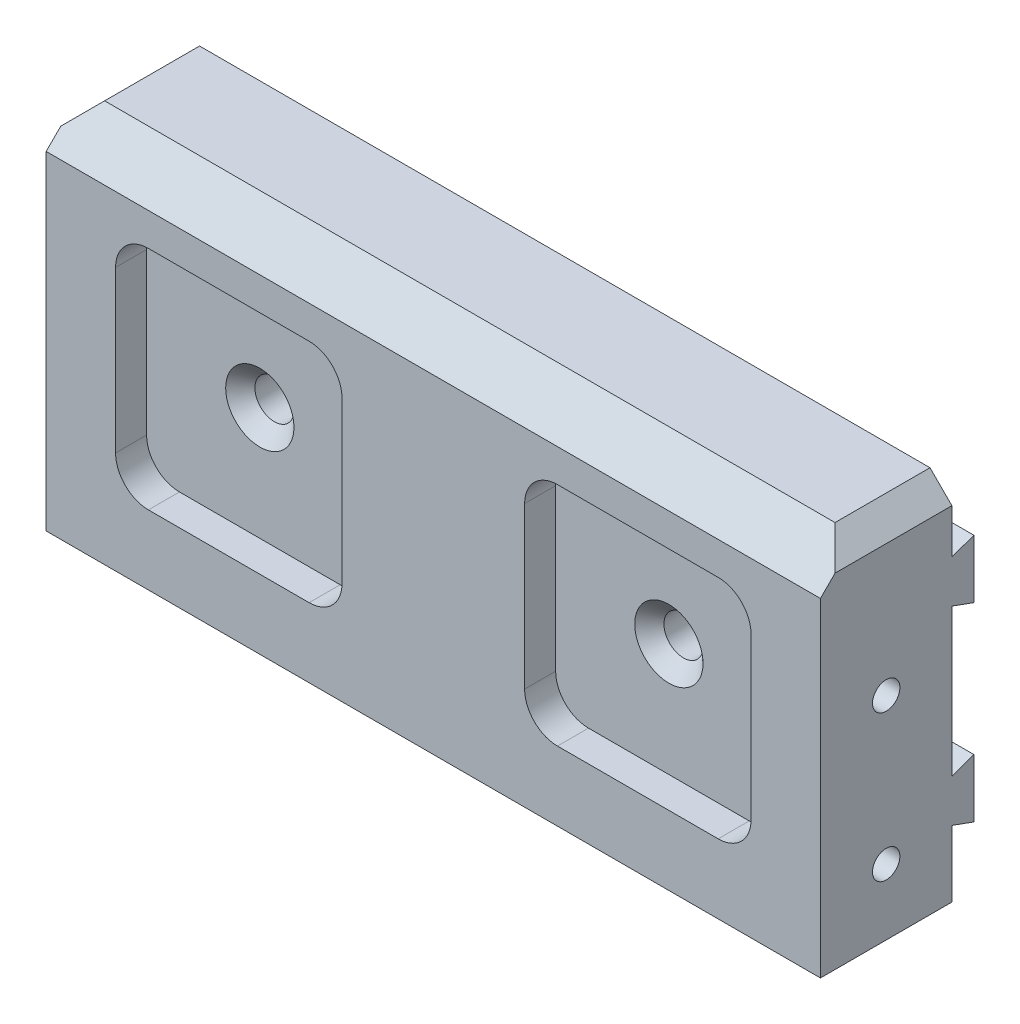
ISO-10303-21;
HEADER;
FILE_DESCRIPTION(('STEP AP214'),'2;1');
FILE_NAME('part.step','',(''),(''),'','','');
FILE_SCHEMA(('AUTOMOTIVE_DESIGN { 1 0 10303 214 1 1 1 1 }'));
ENDSEC;
DATA;
#1=APPLICATION_CONTEXT('core data for automotive mechanical design processes');
#2=APPLICATION_PROTOCOL_DEFINITION('international standard','automotive_design',2000,#1);
#3=PRODUCT_CONTEXT('',#1,'mechanical');
#4=PRODUCT('Part','Part','',(#3));
#5=PRODUCT_RELATED_PRODUCT_CATEGORY('part','',(#4));
#6=PRODUCT_DEFINITION_FORMATION('','',#4);
#7=PRODUCT_DEFINITION_CONTEXT('part definition',#1,'design');
#8=PRODUCT_DEFINITION('design','',#6,#7);
#9=PRODUCT_DEFINITION_SHAPE('','',#8);
#10=(LENGTH_UNIT() NAMED_UNIT(*) SI_UNIT(.MILLI.,.METRE.));
#11=(NAMED_UNIT(*) PLANE_ANGLE_UNIT() SI_UNIT($,.RADIAN.));
#12=(NAMED_UNIT(*) SI_UNIT($,.STERADIAN.) SOLID_ANGLE_UNIT());
#13=UNCERTAINTY_MEASURE_WITH_UNIT(LENGTH_MEASURE(1.E-05),#10,'distance_accuracy_value','');
#14=(GEOMETRIC_REPRESENTATION_CONTEXT(3) GLOBAL_UNCERTAINTY_ASSIGNED_CONTEXT((#13)) GLOBAL_UNIT_ASSIGNED_CONTEXT((#10,
#11,#12)) REPRESENTATION_CONTEXT('',''));
#15=CARTESIAN_POINT('',(0.,0.,0.));
#16=DIRECTION('',(0.,0.,1.));
#17=DIRECTION('',(1.,0.,0.));
#18=AXIS2_PLACEMENT_3D('',#15,#16,#17);
#19=CARTESIAN_POINT('',(0.,0.,-9.));
#20=DIRECTION('',(0.,0.,-1.));
#21=DIRECTION('',(-1.,0.,0.));
#22=AXIS2_PLACEMENT_3D('',#19,#20,#21);
#23=PLANE('',#22);
#24=DIRECTION('',(-1.,0.,0.));
#25=VECTOR('',#24,1.);
#26=CARTESIAN_POINT('',(61.5440037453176,-15.9080892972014,-8.99999999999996));
#27=LINE('',#26,#25);
#28=CARTESIAN_POINT('',(53.,-15.9080892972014,-8.99999999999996));
#29=VERTEX_POINT('',#28);
#30=CARTESIAN_POINT('',(-53.,-15.9080892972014,-8.99999999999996));
#31=VERTEX_POINT('',#30);
#32=EDGE_CURVE('E243',#29,#31,#27,.T.);
#33=ORIENTED_EDGE('',*,*,#32,.F.);
#34=DIRECTION('',(0.,1.,0.));
#35=VECTOR('',#34,1.);
#36=CARTESIAN_POINT('',(53.,-25.,-9.));
#37=LINE('',#36,#35);
#38=CARTESIAN_POINT('',(53.,-25.,-9.));
#39=VERTEX_POINT('',#38);
#40=EDGE_CURVE('E275',#39,#29,#37,.T.);
#41=ORIENTED_EDGE('',*,*,#40,.F.);
#42=DIRECTION('',(1.,0.,0.));
#43=VECTOR('',#42,1.);
#44=CARTESIAN_POINT('',(-53.,-25.,-9.));
#45=LINE('',#44,#43);
#46=CARTESIAN_POINT('',(-53.,-25.,-9.));
#47=VERTEX_POINT('',#46);
#48=EDGE_CURVE('E268',#47,#39,#45,.T.);
#49=ORIENTED_EDGE('',*,*,#48,.F.);
#50=DIRECTION('',(0.,-1.,0.));
#51=VECTOR('',#50,1.);
#52=CARTESIAN_POINT('',(-53.,-25.,-9.));
#53=LINE('',#52,#51);
#54=EDGE_CURVE('E260',#31,#47,#53,.T.);
#55=ORIENTED_EDGE('',*,*,#54,.F.);
#56=EDGE_LOOP('',(#33,#41,#49,#55));
#57=FACE_BOUND('',#56,.T.);
#58=ADVANCED_FACE('F38',(#57),#23,.T.);
#59=DIRECTION('',(-1.,0.,0.));
#60=VECTOR('',#59,1.);
#61=CARTESIAN_POINT('',(-53.,25.,-9.));
#62=LINE('',#61,#60);
#63=CARTESIAN_POINT('',(50.,25.,-9.));
#64=VERTEX_POINT('',#63);
#65=CARTESIAN_POINT('',(-50.,25.,-9.));
#66=VERTEX_POINT('',#65);
#67=EDGE_CURVE('E270',#64,#66,#62,.T.);
#68=ORIENTED_EDGE('',*,*,#67,.F.);
#69=DIRECTION('',(-0.707106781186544,0.707106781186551,0.));
#70=VECTOR('',#69,1.);
#71=CARTESIAN_POINT('',(37.5000000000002,37.4999999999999,-9.));
#72=LINE('',#71,#70);
#73=CARTESIAN_POINT('',(53.,22.,-9.));
#74=VERTEX_POINT('',#73);
#75=EDGE_CURVE('E324',#64,#74,#72,.F.);
#76=ORIENTED_EDGE('',*,*,#75,.T.);
#77=CARTESIAN_POINT('',(53.,15.9080892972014,-9.));
#78=VERTEX_POINT('',#77);
#79=EDGE_CURVE('E518',#78,#74,#37,.T.);
#80=ORIENTED_EDGE('',*,*,#79,.F.);
#81=DIRECTION('',(-1.,0.,0.));
#82=VECTOR('',#81,1.);
#83=CARTESIAN_POINT('',(61.5440037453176,15.9080892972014,-8.99999999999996));
#84=LINE('',#83,#82);
#85=CARTESIAN_POINT('',(-53.,15.9080892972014,-9.));
#86=VERTEX_POINT('',#85);
#87=EDGE_CURVE('E550',#78,#86,#84,.T.);
#88=ORIENTED_EDGE('',*,*,#87,.T.);
#89=CARTESIAN_POINT('',(-53.,22.,-9.));
#90=VERTEX_POINT('',#89);
#91=EDGE_CURVE('E272',#90,#86,#53,.T.);
#92=ORIENTED_EDGE('',*,*,#91,.F.);
#93=DIRECTION('',(-0.707106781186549,-0.707106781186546,0.));
#94=VECTOR('',#93,1.);
#95=CARTESIAN_POINT('',(-37.4999999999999,37.5,-9.));
#96=LINE('',#95,#94);
#97=EDGE_CURVE('E322',#90,#66,#96,.F.);
#98=ORIENTED_EDGE('',*,*,#97,.T.);
#99=EDGE_LOOP('',(#68,#76,#80,#88,#92,#98));
#100=FACE_BOUND('',#99,.T.);
#101=ADVANCED_FACE('F353',(#100),#23,.T.);
#102=CARTESIAN_POINT('',(53.,-25.,9.));
#103=DIRECTION('',(-1.,0.,0.));
#104=DIRECTION('',(0.,0.,1.));
#105=AXIS2_PLACEMENT_3D('',#102,#103,#104);
#106=PLANE('',#105);
#107=CARTESIAN_POINT('',(53.,-16.,0.));
#108=DIRECTION('',(-1.,0.,0.));
#109=DIRECTION('',(0.,0.,1.));
#110=AXIS2_PLACEMENT_3D('',#107,#108,#109);
#111=CIRCLE('',#110,1.875);
#112=CARTESIAN_POINT('',(53.,-16.,1.875));
#113=VERTEX_POINT('',#112);
#114=EDGE_CURVE('E718',#113,#113,#111,.T.);
#115=ORIENTED_EDGE('',*,*,#114,.T.);
#116=EDGE_LOOP('',(#115));
#117=FACE_BOUND('',#116,.T.);
#118=CARTESIAN_POINT('',(53.,3.99999999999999,0.));
#119=DIRECTION('',(-1.,0.,0.));
#120=DIRECTION('',(0.,0.,1.));
#121=AXIS2_PLACEMENT_3D('',#118,#119,#120);
#122=CIRCLE('',#121,1.875);
#123=CARTESIAN_POINT('',(53.,3.99999999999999,1.875));
#124=VERTEX_POINT('',#123);
#125=EDGE_CURVE('E712',#124,#124,#122,.T.);
#126=ORIENTED_EDGE('',*,*,#125,.T.);
#127=EDGE_LOOP('',(#126));
#128=FACE_BOUND('',#127,.T.);
#129=ORIENTED_EDGE('',*,*,#79,.T.);
#130=DIRECTION('',(0.,0.,1.));
#131=VECTOR('',#130,1.);
#132=CARTESIAN_POINT('',(53.,22.,9.));
#133=LINE('',#132,#131);
#134=CARTESIAN_POINT('',(53.,22.,6.99999999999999));
#135=VERTEX_POINT('',#134);
#136=EDGE_CURVE('E61',#74,#135,#133,.T.);
#137=ORIENTED_EDGE('',*,*,#136,.T.);
#138=DIRECTION('',(0.,0.707106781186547,-0.707106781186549));
#139=VECTOR('',#138,1.);
#140=CARTESIAN_POINT('',(53.,20.,9.));
#141=LINE('',#140,#139);
#142=CARTESIAN_POINT('',(53.,20.,9.));
#143=VERTEX_POINT('',#142);
#144=EDGE_CURVE('E303',#135,#143,#141,.F.);
#145=ORIENTED_EDGE('',*,*,#144,.T.);
#146=DIRECTION('',(0.,1.,0.));
#147=VECTOR('',#146,1.);
#148=CARTESIAN_POINT('',(53.,-25.,9.));
#149=LINE('',#148,#147);
#150=CARTESIAN_POINT('',(53.,-25.,9.));
#151=VERTEX_POINT('',#150);
#152=EDGE_CURVE('E282',#151,#143,#149,.T.);
#153=ORIENTED_EDGE('',*,*,#152,.F.);
#154=DIRECTION('',(0.,0.,-1.));
#155=VECTOR('',#154,1.);
#156=CARTESIAN_POINT('',(53.,-25.,9.));
#157=LINE('',#156,#155);
#158=EDGE_CURVE('E290',#151,#39,#157,.T.);
#159=ORIENTED_EDGE('',*,*,#158,.T.);
#160=ORIENTED_EDGE('',*,*,#40,.T.);
#161=DIRECTION('',(0.,-0.342020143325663,-0.939692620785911));
#162=VECTOR('',#161,1.);
#163=CARTESIAN_POINT('',(53.,-17.,-12.));
#164=LINE('',#163,#162);
#165=CARTESIAN_POINT('',(53.,-17.,-12.));
#166=VERTEX_POINT('',#165);
#167=EDGE_CURVE('E249',#29,#166,#164,.T.);
#168=ORIENTED_EDGE('',*,*,#167,.T.);
#169=DIRECTION('',(0.,1.,0.));
#170=VECTOR('',#169,1.);
#171=CARTESIAN_POINT('',(53.,-8.99999999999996,-12.));
#172=LINE('',#171,#170);
#173=CARTESIAN_POINT('',(53.,-8.99999999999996,-12.));
#174=VERTEX_POINT('',#173);
#175=EDGE_CURVE('E564',#166,#174,#172,.T.);
#176=ORIENTED_EDGE('',*,*,#175,.T.);
#177=DIRECTION('',(0.,-0.342020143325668,0.939692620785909));
#178=VECTOR('',#177,1.);
#179=CARTESIAN_POINT('',(53.,-10.0919107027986,-9.));
#180=LINE('',#179,#178);
#181=CARTESIAN_POINT('',(53.,-10.0919107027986,-9.));
#182=VERTEX_POINT('',#181);
#183=EDGE_CURVE('E694',#174,#182,#180,.T.);
#184=ORIENTED_EDGE('',*,*,#183,.T.);
#185=CARTESIAN_POINT('',(53.,10.0919107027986,-9.));
#186=VERTEX_POINT('',#185);
#187=EDGE_CURVE('E532',#182,#186,#37,.T.);
#188=ORIENTED_EDGE('',*,*,#187,.T.);
#189=DIRECTION('',(0.,-0.342020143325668,-0.939692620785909));
#190=VECTOR('',#189,1.);
#191=CARTESIAN_POINT('',(53.,10.0919107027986,-9.));
#192=LINE('',#191,#190);
#193=CARTESIAN_POINT('',(53.,8.99999999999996,-12.));
#194=VERTEX_POINT('',#193);
#195=EDGE_CURVE('E567',#186,#194,#192,.T.);
#196=ORIENTED_EDGE('',*,*,#195,.T.);
#197=DIRECTION('',(0.,1.,0.));
#198=VECTOR('',#197,1.);
#199=CARTESIAN_POINT('',(53.,8.99999999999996,-12.));
#200=LINE('',#199,#198);
#201=CARTESIAN_POINT('',(53.,17.,-12.));
#202=VERTEX_POINT('',#201);
#203=EDGE_CURVE('E575',#194,#202,#200,.T.);
#204=ORIENTED_EDGE('',*,*,#203,.T.);
#205=DIRECTION('',(0.,-0.342020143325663,0.939692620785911));
#206=VECTOR('',#205,1.);
#207=CARTESIAN_POINT('',(53.,17.,-12.));
#208=LINE('',#207,#206);
#209=EDGE_CURVE('E535',#202,#78,#208,.T.);
#210=ORIENTED_EDGE('',*,*,#209,.T.);
#211=EDGE_LOOP('',(#129,#137,#145,#153,#159,#160,#168,#176,#184,#188,#196,#204,#210));
#212=FACE_BOUND('',#211,.T.);
#213=ADVANCED_FACE('F359',(#117,#128,#212),#106,.F.);
#214=CARTESIAN_POINT('',(-53.,25.,9.));
#215=DIRECTION('',(0.,-1.,0.));
#216=DIRECTION('',(0.,0.,-1.));
#217=AXIS2_PLACEMENT_3D('',#214,#215,#216);
#218=PLANE('',#217);
#219=DIRECTION('',(1.,0.,0.));
#220=VECTOR('',#219,1.);
#221=CARTESIAN_POINT('',(-53.,25.,3.99999999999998));
#222=LINE('',#221,#220);
#223=CARTESIAN_POINT('',(-50.,25.,3.99999999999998));
#224=VERTEX_POINT('',#223);
#225=CARTESIAN_POINT('',(50.,25.,3.99999999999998));
#226=VERTEX_POINT('',#225);
#227=EDGE_CURVE('E300',#224,#226,#222,.T.);
#228=ORIENTED_EDGE('',*,*,#227,.T.);
#229=DIRECTION('',(0.,0.,-1.));
#230=VECTOR('',#229,1.);
#231=CARTESIAN_POINT('',(50.,25.,9.));
#232=LINE('',#231,#230);
#233=EDGE_CURVE('E319',#226,#64,#232,.T.);
#234=ORIENTED_EDGE('',*,*,#233,.T.);
#235=ORIENTED_EDGE('',*,*,#67,.T.);
#236=DIRECTION('',(0.,0.,1.));
#237=VECTOR('',#236,1.);
#238=CARTESIAN_POINT('',(-50.,25.,9.));
#239=LINE('',#238,#237);
#240=EDGE_CURVE('E317',#66,#224,#239,.T.);
#241=ORIENTED_EDGE('',*,*,#240,.T.);
#242=EDGE_LOOP('',(#228,#234,#235,#241));
#243=FACE_BOUND('',#242,.T.);
#244=ADVANCED_FACE('F543',(#243),#218,.F.);
#245=CARTESIAN_POINT('',(-53.,-25.,9.));
#246=DIRECTION('',(1.,0.,0.));
#247=DIRECTION('',(0.,0.,-1.));
#248=AXIS2_PLACEMENT_3D('',#245,#246,#247);
#249=PLANE('',#248);
#250=CARTESIAN_POINT('',(-53.,-16.,0.));
#251=DIRECTION('',(-1.,0.,0.));
#252=DIRECTION('',(0.,0.,1.));
#253=AXIS2_PLACEMENT_3D('',#250,#251,#252);
#254=CIRCLE('',#253,1.875);
#255=CARTESIAN_POINT('',(-53.,-16.,1.875));
#256=VERTEX_POINT('',#255);
#257=EDGE_CURVE('E706',#256,#256,#254,.T.);
#258=ORIENTED_EDGE('',*,*,#257,.F.);
#259=EDGE_LOOP('',(#258));
#260=FACE_BOUND('',#259,.T.);
#261=CARTESIAN_POINT('',(-53.,3.99999999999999,0.));
#262=DIRECTION('',(-1.,0.,0.));
#263=DIRECTION('',(0.,0.,1.));
#264=AXIS2_PLACEMENT_3D('',#261,#262,#263);
#265=CIRCLE('',#264,1.875);
#266=CARTESIAN_POINT('',(-53.,3.99999999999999,1.875));
#267=VERTEX_POINT('',#266);
#268=EDGE_CURVE('E700',#267,#267,#265,.T.);
#269=ORIENTED_EDGE('',*,*,#268,.F.);
#270=EDGE_LOOP('',(#269));
#271=FACE_BOUND('',#270,.T.);
#272=DIRECTION('',(0.,-0.707106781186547,0.707106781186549));
#273=VECTOR('',#272,1.);
#274=CARTESIAN_POINT('',(-53.,20.,9.));
#275=LINE('',#274,#273);
#276=CARTESIAN_POINT('',(-53.,20.,9.));
#277=VERTEX_POINT('',#276);
#278=CARTESIAN_POINT('',(-53.,22.,6.99999999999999));
#279=VERTEX_POINT('',#278);
#280=EDGE_CURVE('E298',#277,#279,#275,.F.);
#281=ORIENTED_EDGE('',*,*,#280,.T.);
#282=DIRECTION('',(0.,0.,-1.));
#283=VECTOR('',#282,1.);
#284=CARTESIAN_POINT('',(-53.,22.,9.));
#285=LINE('',#284,#283);
#286=EDGE_CURVE('E330',#279,#90,#285,.T.);
#287=ORIENTED_EDGE('',*,*,#286,.T.);
#288=ORIENTED_EDGE('',*,*,#91,.T.);
#289=DIRECTION('',(0.,0.342020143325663,-0.939692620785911));
#290=VECTOR('',#289,1.);
#291=CARTESIAN_POINT('',(-53.,17.,-12.));
#292=LINE('',#291,#290);
#293=CARTESIAN_POINT('',(-53.,17.,-12.));
#294=VERTEX_POINT('',#293);
#295=EDGE_CURVE('E556',#86,#294,#292,.T.);
#296=ORIENTED_EDGE('',*,*,#295,.T.);
#297=DIRECTION('',(0.,-1.,0.));
#298=VECTOR('',#297,1.);
#299=CARTESIAN_POINT('',(-53.,8.99999999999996,-12.));
#300=LINE('',#299,#298);
#301=CARTESIAN_POINT('',(-53.,8.99999999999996,-12.));
#302=VERTEX_POINT('',#301);
#303=EDGE_CURVE('E561',#294,#302,#300,.T.);
#304=ORIENTED_EDGE('',*,*,#303,.T.);
#305=DIRECTION('',(0.,0.342020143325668,0.939692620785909));
#306=VECTOR('',#305,1.);
#307=CARTESIAN_POINT('',(-53.,10.0919107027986,-9.));
#308=LINE('',#307,#306);
#309=CARTESIAN_POINT('',(-53.,10.0919107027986,-9.));
#310=VERTEX_POINT('',#309);
#311=EDGE_CURVE('E554',#302,#310,#308,.T.);
#312=ORIENTED_EDGE('',*,*,#311,.T.);
#313=CARTESIAN_POINT('',(-53.,-10.0919107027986,-9.));
#314=VERTEX_POINT('',#313);
#315=EDGE_CURVE('E269',#310,#314,#53,.T.);
#316=ORIENTED_EDGE('',*,*,#315,.T.);
#317=DIRECTION('',(0.,0.342020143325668,-0.939692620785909));
#318=VECTOR('',#317,1.);
#319=CARTESIAN_POINT('',(-53.,-10.0919107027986,-9.));
#320=LINE('',#319,#318);
#321=CARTESIAN_POINT('',(-53.,-8.99999999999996,-12.));
#322=VERTEX_POINT('',#321);
#323=EDGE_CURVE('E264',#314,#322,#320,.T.);
#324=ORIENTED_EDGE('',*,*,#323,.T.);
#325=DIRECTION('',(0.,-1.,0.));
#326=VECTOR('',#325,1.);
#327=CARTESIAN_POINT('',(-53.,-8.99999999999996,-12.));
#328=LINE('',#327,#326);
#329=CARTESIAN_POINT('',(-53.,-17.,-12.));
#330=VERTEX_POINT('',#329);
#331=EDGE_CURVE('E255',#322,#330,#328,.T.);
#332=ORIENTED_EDGE('',*,*,#331,.T.);
#333=DIRECTION('',(0.,0.342020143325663,0.939692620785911));
#334=VECTOR('',#333,1.);
#335=CARTESIAN_POINT('',(-53.,-17.,-12.));
#336=LINE('',#335,#334);
#337=EDGE_CURVE('E247',#330,#31,#336,.T.);
#338=ORIENTED_EDGE('',*,*,#337,.T.);
#339=ORIENTED_EDGE('',*,*,#54,.T.);
#340=DIRECTION('',(0.,0.,-1.));
#341=VECTOR('',#340,1.);
#342=CARTESIAN_POINT('',(-53.,-25.,9.));
#343=LINE('',#342,#341);
#344=CARTESIAN_POINT('',(-53.,-25.,9.));
#345=VERTEX_POINT('',#344);
#346=EDGE_CURVE('E292',#345,#47,#343,.T.);
#347=ORIENTED_EDGE('',*,*,#346,.F.);
#348=DIRECTION('',(0.,-1.,0.));
#349=VECTOR('',#348,1.);
#350=CARTESIAN_POINT('',(-53.,-25.,9.));
#351=LINE('',#350,#349);
#352=EDGE_CURVE('E287',#277,#345,#351,.T.);
#353=ORIENTED_EDGE('',*,*,#352,.F.);
#354=EDGE_LOOP('',(#281,#287,#288,#296,#304,#312,#316,#324,#332,#338,#339,#347,#353));
#355=FACE_BOUND('',#354,.T.);
#356=ADVANCED_FACE('F258',(#260,#271,#355),#249,.F.);
#357=CARTESIAN_POINT('',(-53.,-25.,9.));
#358=DIRECTION('',(0.,1.,0.));
#359=DIRECTION('',(0.,0.,1.));
#360=AXIS2_PLACEMENT_3D('',#357,#358,#359);
#361=PLANE('',#360);
#362=ORIENTED_EDGE('',*,*,#48,.T.);
#363=ORIENTED_EDGE('',*,*,#158,.F.);
#364=DIRECTION('',(1.,0.,0.));
#365=VECTOR('',#364,1.);
#366=CARTESIAN_POINT('',(-53.,-25.,9.));
#367=LINE('',#366,#365);
#368=EDGE_CURVE('E293',#345,#151,#367,.T.);
#369=ORIENTED_EDGE('',*,*,#368,.F.);
#370=ORIENTED_EDGE('',*,*,#346,.T.);
#371=EDGE_LOOP('',(#362,#363,#369,#370));
#372=FACE_BOUND('',#371,.T.);
#373=ADVANCED_FACE('F373',(#372),#361,.F.);
#374=CARTESIAN_POINT('',(0.,0.,9.));
#375=DIRECTION('',(0.,0.,-1.));
#376=DIRECTION('',(-1.,0.,0.));
#377=AXIS2_PLACEMENT_3D('',#374,#375,#376);
#378=PLANE('',#377);
#379=DIRECTION('',(0.,1.,0.));
#380=VECTOR('',#379,1.);
#381=CARTESIAN_POINT('',(43.5,-11.,9.));
#382=LINE('',#381,#380);
#383=CARTESIAN_POINT('',(43.5,-11.,9.));
#384=VERTEX_POINT('',#383);
#385=CARTESIAN_POINT('',(43.5,11.,9.));
#386=VERTEX_POINT('',#385);
#387=EDGE_CURVE('E608',#384,#386,#382,.T.);
#388=ORIENTED_EDGE('',*,*,#387,.F.);
#389=CARTESIAN_POINT('',(39.,-11.,9.));
#390=DIRECTION('',(0.,0.,1.));
#391=DIRECTION('',(1.,0.,0.));
#392=AXIS2_PLACEMENT_3D('',#389,#390,#391);
#393=CIRCLE('',#392,4.5);
#394=CARTESIAN_POINT('',(39.,-15.5,9.));
#395=VERTEX_POINT('',#394);
#396=EDGE_CURVE('E580',#395,#384,#393,.T.);
#397=ORIENTED_EDGE('',*,*,#396,.F.);
#398=DIRECTION('',(1.,0.,0.));
#399=VECTOR('',#398,1.);
#400=CARTESIAN_POINT('',(17.,-15.5,9.));
#401=LINE('',#400,#399);
#402=CARTESIAN_POINT('',(17.,-15.5,9.));
#403=VERTEX_POINT('',#402);
#404=EDGE_CURVE('E585',#403,#395,#401,.T.);
#405=ORIENTED_EDGE('',*,*,#404,.F.);
#406=CARTESIAN_POINT('',(17.,-11.,9.));
#407=DIRECTION('',(0.,0.,1.));
#408=DIRECTION('',(1.,0.,0.));
#409=AXIS2_PLACEMENT_3D('',#406,#407,#408);
#410=CIRCLE('',#409,4.5);
#411=CARTESIAN_POINT('',(12.5,-11.,9.));
#412=VERTEX_POINT('',#411);
#413=EDGE_CURVE('E623',#412,#403,#410,.T.);
#414=ORIENTED_EDGE('',*,*,#413,.F.);
#415=DIRECTION('',(0.,-1.,0.));
#416=VECTOR('',#415,1.);
#417=CARTESIAN_POINT('',(12.5,11.,9.));
#418=LINE('',#417,#416);
#419=CARTESIAN_POINT('',(12.5,11.,9.));
#420=VERTEX_POINT('',#419);
#421=EDGE_CURVE('E620',#420,#412,#418,.T.);
#422=ORIENTED_EDGE('',*,*,#421,.F.);
#423=CARTESIAN_POINT('',(17.,11.,9.));
#424=DIRECTION('',(0.,0.,1.));
#425=DIRECTION('',(1.,0.,0.));
#426=AXIS2_PLACEMENT_3D('',#423,#424,#425);
#427=CIRCLE('',#426,4.5);
#428=CARTESIAN_POINT('',(17.,15.5,9.));
#429=VERTEX_POINT('',#428);
#430=EDGE_CURVE('E617',#429,#420,#427,.T.);
#431=ORIENTED_EDGE('',*,*,#430,.F.);
#432=DIRECTION('',(-1.,0.,0.));
#433=VECTOR('',#432,1.);
#434=CARTESIAN_POINT('',(39.,15.5,9.));
#435=LINE('',#434,#433);
#436=CARTESIAN_POINT('',(39.,15.5,9.));
#437=VERTEX_POINT('',#436);
#438=EDGE_CURVE('E614',#437,#429,#435,.T.);
#439=ORIENTED_EDGE('',*,*,#438,.F.);
#440=CARTESIAN_POINT('',(39.,11.,9.));
#441=DIRECTION('',(0.,0.,1.));
#442=DIRECTION('',(1.,0.,0.));
#443=AXIS2_PLACEMENT_3D('',#440,#441,#442);
#444=CIRCLE('',#443,4.5);
#445=EDGE_CURVE('E611',#386,#437,#444,.T.);
#446=ORIENTED_EDGE('',*,*,#445,.F.);
#447=EDGE_LOOP('',(#388,#397,#405,#414,#422,#431,#439,#446));
#448=FACE_BOUND('',#447,.T.);
#449=DIRECTION('',(0.,1.,0.));
#450=VECTOR('',#449,1.);
#451=CARTESIAN_POINT('',(-12.5,11.,9.));
#452=LINE('',#451,#450);
#453=CARTESIAN_POINT('',(-12.5,-11.,9.));
#454=VERTEX_POINT('',#453);
#455=CARTESIAN_POINT('',(-12.5,11.,9.));
#456=VERTEX_POINT('',#455);
#457=EDGE_CURVE('E483',#454,#456,#452,.T.);
#458=ORIENTED_EDGE('',*,*,#457,.F.);
#459=CARTESIAN_POINT('',(-17.,-11.,9.));
#460=DIRECTION('',(0.,0.,1.));
#461=DIRECTION('',(-1.,0.,0.));
#462=AXIS2_PLACEMENT_3D('',#459,#460,#461);
#463=CIRCLE('',#462,4.5);
#464=CARTESIAN_POINT('',(-17.,-15.5,9.));
#465=VERTEX_POINT('',#464);
#466=EDGE_CURVE('E473',#465,#454,#463,.T.);
#467=ORIENTED_EDGE('',*,*,#466,.F.);
#468=DIRECTION('',(1.,0.,0.));
#469=VECTOR('',#468,1.);
#470=CARTESIAN_POINT('',(-17.,-15.5,9.));
#471=LINE('',#470,#469);
#472=CARTESIAN_POINT('',(-39.,-15.5,9.));
#473=VERTEX_POINT('',#472);
#474=EDGE_CURVE('E514',#473,#465,#471,.T.);
#475=ORIENTED_EDGE('',*,*,#474,.F.);
#476=CARTESIAN_POINT('',(-39.,-11.,9.));
#477=DIRECTION('',(0.,0.,1.));
#478=DIRECTION('',(-1.,0.,0.));
#479=AXIS2_PLACEMENT_3D('',#476,#477,#478);
#480=CIRCLE('',#479,4.5);
#481=CARTESIAN_POINT('',(-43.5,-11.,9.));
#482=VERTEX_POINT('',#481);
#483=EDGE_CURVE('E511',#482,#473,#480,.T.);
#484=ORIENTED_EDGE('',*,*,#483,.F.);
#485=DIRECTION('',(0.,-1.,0.));
#486=VECTOR('',#485,1.);
#487=CARTESIAN_POINT('',(-43.5,-11.,9.));
#488=LINE('',#487,#486);
#489=CARTESIAN_POINT('',(-43.5,11.,9.));
#490=VERTEX_POINT('',#489);
#491=EDGE_CURVE('E508',#490,#482,#488,.T.);
#492=ORIENTED_EDGE('',*,*,#491,.F.);
#493=CARTESIAN_POINT('',(-39.,11.,9.));
#494=DIRECTION('',(0.,0.,1.));
#495=DIRECTION('',(-1.,0.,0.));
#496=AXIS2_PLACEMENT_3D('',#493,#494,#495);
#497=CIRCLE('',#496,4.5);
#498=CARTESIAN_POINT('',(-39.,15.5,9.));
#499=VERTEX_POINT('',#498);
#500=EDGE_CURVE('E505',#499,#490,#497,.T.);
#501=ORIENTED_EDGE('',*,*,#500,.F.);
#502=DIRECTION('',(-1.,0.,0.));
#503=VECTOR('',#502,1.);
#504=CARTESIAN_POINT('',(-39.,15.5,9.));
#505=LINE('',#504,#503);
#506=CARTESIAN_POINT('',(-17.,15.5,9.));
#507=VERTEX_POINT('',#506);
#508=EDGE_CURVE('E499',#507,#499,#505,.T.);
#509=ORIENTED_EDGE('',*,*,#508,.F.);
#510=CARTESIAN_POINT('',(-17.,11.,9.));
#511=DIRECTION('',(0.,0.,1.));
#512=DIRECTION('',(-1.,0.,0.));
#513=AXIS2_PLACEMENT_3D('',#510,#511,#512);
#514=CIRCLE('',#513,4.5);
#515=EDGE_CURVE('E497',#456,#507,#514,.T.);
#516=ORIENTED_EDGE('',*,*,#515,.F.);
#517=EDGE_LOOP('',(#458,#467,#475,#484,#492,#501,#509,#516));
#518=FACE_BOUND('',#517,.T.);
#519=ORIENTED_EDGE('',*,*,#152,.T.);
#520=DIRECTION('',(-1.,0.,0.));
#521=VECTOR('',#520,1.);
#522=CARTESIAN_POINT('',(0.,20.,9.));
#523=LINE('',#522,#521);
#524=EDGE_CURVE('E295',#143,#277,#523,.T.);
#525=ORIENTED_EDGE('',*,*,#524,.T.);
#526=ORIENTED_EDGE('',*,*,#352,.T.);
#527=ORIENTED_EDGE('',*,*,#368,.T.);
#528=EDGE_LOOP('',(#519,#525,#526,#527));
#529=FACE_BOUND('',#528,.T.);
#530=ADVANCED_FACE('F365',(#448,#518,#529),#378,.F.);
#531=DIRECTION('',(-1.,0.,0.));
#532=VECTOR('',#531,1.);
#533=CARTESIAN_POINT('',(61.5440037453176,-10.0919107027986,-9.));
#534=LINE('',#533,#532);
#535=EDGE_CURVE('E254',#182,#314,#534,.T.);
#536=ORIENTED_EDGE('',*,*,#535,.T.);
#537=ORIENTED_EDGE('',*,*,#315,.F.);
#538=DIRECTION('',(-1.,0.,0.));
#539=VECTOR('',#538,1.);
#540=CARTESIAN_POINT('',(61.5440037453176,10.0919107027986,-9.));
#541=LINE('',#540,#539);
#542=EDGE_CURVE('E572',#186,#310,#541,.T.);
#543=ORIENTED_EDGE('',*,*,#542,.F.);
#544=ORIENTED_EDGE('',*,*,#187,.F.);
#545=EDGE_LOOP('',(#536,#537,#543,#544));
#546=FACE_BOUND('',#545,.T.);
#547=CARTESIAN_POINT('',(-28.,-1.17961196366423E-13,-9.));
#548=DIRECTION('',(0.,0.,-1.));
#549=DIRECTION('',(-1.,0.,0.));
#550=AXIS2_PLACEMENT_3D('',#547,#548,#549);
#551=CIRCLE('',#550,5.67499999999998);
#552=CARTESIAN_POINT('',(-33.675,-1.17961196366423E-13,-9.));
#553=VERTEX_POINT('',#552);
#554=EDGE_CURVE('E311',#553,#553,#551,.F.);
#555=ORIENTED_EDGE('',*,*,#554,.T.);
#556=EDGE_LOOP('',(#555));
#557=FACE_BOUND('',#556,.T.);
#558=CARTESIAN_POINT('',(28.,-1.2490009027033E-13,-9.));
#559=DIRECTION('',(0.,0.,-1.));
#560=DIRECTION('',(-1.,0.,0.));
#561=AXIS2_PLACEMENT_3D('',#558,#559,#560);
#562=CIRCLE('',#561,5.67500000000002);
#563=CARTESIAN_POINT('',(22.325,-1.2490009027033E-13,-9.));
#564=VERTEX_POINT('',#563);
#565=EDGE_CURVE('E308',#564,#564,#562,.F.);
#566=ORIENTED_EDGE('',*,*,#565,.T.);
#567=EDGE_LOOP('',(#566));
#568=FACE_BOUND('',#567,.T.);
#569=ADVANCED_FACE('F355',(#546,#557,#568),#23,.T.);
#570=CARTESIAN_POINT('',(0.,20.,9.));
#571=DIRECTION('',(0.,-0.707106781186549,-0.707106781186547));
#572=DIRECTION('',(-1.,0.,0.));
#573=AXIS2_PLACEMENT_3D('',#570,#571,#572);
#574=PLANE('',#573);
#575=ORIENTED_EDGE('',*,*,#144,.F.);
#576=DIRECTION('',(-0.577350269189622,0.577350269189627,-0.577350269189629));
#577=VECTOR('',#576,1.);
#578=CARTESIAN_POINT('',(36.6666666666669,38.3333333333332,-9.33333333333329));
#579=LINE('',#578,#577);
#580=EDGE_CURVE('E328',#135,#226,#579,.T.);
#581=ORIENTED_EDGE('',*,*,#580,.T.);
#582=ORIENTED_EDGE('',*,*,#227,.F.);
#583=DIRECTION('',(-0.577350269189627,-0.577350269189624,0.577350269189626));
#584=VECTOR('',#583,1.);
#585=CARTESIAN_POINT('',(-36.6666666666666,38.3333333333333,-9.33333333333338));
#586=LINE('',#585,#584);
#587=EDGE_CURVE('E53',#224,#279,#586,.T.);
#588=ORIENTED_EDGE('',*,*,#587,.T.);
#589=ORIENTED_EDGE('',*,*,#280,.F.);
#590=ORIENTED_EDGE('',*,*,#524,.F.);
#591=EDGE_LOOP('',(#575,#581,#582,#588,#589,#590));
#592=FACE_BOUND('',#591,.T.);
#593=ADVANCED_FACE('F364',(#592),#574,.F.);
#594=CARTESIAN_POINT('',(-17.,-11.,4.75));
#595=DIRECTION('',(0.,0.,1.));
#596=DIRECTION('',(1.,0.,0.));
#597=AXIS2_PLACEMENT_3D('',#594,#595,#596);
#598=CYLINDRICAL_SURFACE('',#597,4.5);
#599=ORIENTED_EDGE('',*,*,#466,.T.);
#600=DIRECTION('',(0.,0.,1.));
#601=VECTOR('',#600,1.);
#602=CARTESIAN_POINT('',(-12.5,-11.,4.75));
#603=LINE('',#602,#601);
#604=CARTESIAN_POINT('',(-12.5,-11.,4.75));
#605=VERTEX_POINT('',#604);
#606=EDGE_CURVE('E476',#605,#454,#603,.T.);
#607=ORIENTED_EDGE('',*,*,#606,.F.);
#608=CARTESIAN_POINT('',(-17.,-11.,4.75));
#609=DIRECTION('',(0.,0.,1.));
#610=DIRECTION('',(-1.,0.,0.));
#611=AXIS2_PLACEMENT_3D('',#608,#609,#610);
#612=CIRCLE('',#611,4.5);
#613=CARTESIAN_POINT('',(-17.,-15.5,4.75));
#614=VERTEX_POINT('',#613);
#615=EDGE_CURVE('E516',#614,#605,#612,.T.);
#616=ORIENTED_EDGE('',*,*,#615,.F.);
#617=DIRECTION('',(0.,0.,1.));
#618=VECTOR('',#617,1.);
#619=CARTESIAN_POINT('',(-17.,-15.5,4.75));
#620=LINE('',#619,#618);
#621=EDGE_CURVE('E478',#614,#465,#620,.T.);
#622=ORIENTED_EDGE('',*,*,#621,.T.);
#623=EDGE_LOOP('',(#599,#607,#616,#622));
#624=FACE_BOUND('',#623,.T.);
#625=ADVANCED_FACE('F371',(#624),#598,.F.);
#626=CARTESIAN_POINT('',(-17.,-15.5,4.75));
#627=DIRECTION('',(0.,-1.,0.));
#628=DIRECTION('',(1.,0.,0.));
#629=AXIS2_PLACEMENT_3D('',#626,#627,#628);
#630=PLANE('',#629);
#631=ORIENTED_EDGE('',*,*,#474,.T.);
#632=ORIENTED_EDGE('',*,*,#621,.F.);
#633=DIRECTION('',(1.,0.,0.));
#634=VECTOR('',#633,1.);
#635=CARTESIAN_POINT('',(-17.,-15.5,4.75));
#636=LINE('',#635,#634);
#637=CARTESIAN_POINT('',(-39.,-15.5,4.75));
#638=VERTEX_POINT('',#637);
#639=EDGE_CURVE('E492',#638,#614,#636,.T.);
#640=ORIENTED_EDGE('',*,*,#639,.F.);
#641=DIRECTION('',(0.,0.,1.));
#642=VECTOR('',#641,1.);
#643=CARTESIAN_POINT('',(-39.,-15.5,4.75));
#644=LINE('',#643,#642);
#645=EDGE_CURVE('E519',#638,#473,#644,.T.);
#646=ORIENTED_EDGE('',*,*,#645,.T.);
#647=EDGE_LOOP('',(#631,#632,#640,#646));
#648=FACE_BOUND('',#647,.T.);
#649=ADVANCED_FACE('F441',(#648),#630,.F.);
#650=CARTESIAN_POINT('',(-39.,-11.,4.75));
#651=DIRECTION('',(0.,0.,1.));
#652=DIRECTION('',(1.,0.,0.));
#653=AXIS2_PLACEMENT_3D('',#650,#651,#652);
#654=CYLINDRICAL_SURFACE('',#653,4.5);
#655=ORIENTED_EDGE('',*,*,#483,.T.);
#656=ORIENTED_EDGE('',*,*,#645,.F.);
#657=CARTESIAN_POINT('',(-39.,-11.,4.75));
#658=DIRECTION('',(0.,0.,1.));
#659=DIRECTION('',(-1.,0.,0.));
#660=AXIS2_PLACEMENT_3D('',#657,#658,#659);
#661=CIRCLE('',#660,4.5);
#662=CARTESIAN_POINT('',(-43.5,-11.,4.75));
#663=VERTEX_POINT('',#662);
#664=EDGE_CURVE('E657',#663,#638,#661,.T.);
#665=ORIENTED_EDGE('',*,*,#664,.F.);
#666=DIRECTION('',(0.,0.,1.));
#667=VECTOR('',#666,1.);
#668=CARTESIAN_POINT('',(-43.5,-11.,4.75));
#669=LINE('',#668,#667);
#670=EDGE_CURVE('E521',#663,#482,#669,.T.);
#671=ORIENTED_EDGE('',*,*,#670,.T.);
#672=EDGE_LOOP('',(#655,#656,#665,#671));
#673=FACE_BOUND('',#672,.T.);
#674=ADVANCED_FACE('F444',(#673),#654,.F.);
#675=CARTESIAN_POINT('',(-43.5,-11.,4.75));
#676=DIRECTION('',(-1.,0.,0.));
#677=DIRECTION('',(0.,0.,1.));
#678=AXIS2_PLACEMENT_3D('',#675,#676,#677);
#679=PLANE('',#678);
#680=ORIENTED_EDGE('',*,*,#491,.T.);
#681=ORIENTED_EDGE('',*,*,#670,.F.);
#682=DIRECTION('',(0.,-1.,0.));
#683=VECTOR('',#682,1.);
#684=CARTESIAN_POINT('',(-43.5,-11.,4.75));
#685=LINE('',#684,#683);
#686=CARTESIAN_POINT('',(-43.5,11.,4.75));
#687=VERTEX_POINT('',#686);
#688=EDGE_CURVE('E654',#687,#663,#685,.T.);
#689=ORIENTED_EDGE('',*,*,#688,.F.);
#690=DIRECTION('',(0.,0.,1.));
#691=VECTOR('',#690,1.);
#692=CARTESIAN_POINT('',(-43.5,11.,4.75));
#693=LINE('',#692,#691);
#694=EDGE_CURVE('E523',#687,#490,#693,.T.);
#695=ORIENTED_EDGE('',*,*,#694,.T.);
#696=EDGE_LOOP('',(#680,#681,#689,#695));
#697=FACE_BOUND('',#696,.T.);
#698=ADVANCED_FACE('F448',(#697),#679,.F.);
#699=CARTESIAN_POINT('',(-39.,11.,4.75));
#700=DIRECTION('',(0.,0.,1.));
#701=DIRECTION('',(1.,0.,0.));
#702=AXIS2_PLACEMENT_3D('',#699,#700,#701);
#703=CYLINDRICAL_SURFACE('',#702,4.5);
#704=ORIENTED_EDGE('',*,*,#500,.T.);
#705=ORIENTED_EDGE('',*,*,#694,.F.);
#706=CARTESIAN_POINT('',(-39.,11.,4.75));
#707=DIRECTION('',(0.,0.,1.));
#708=DIRECTION('',(-1.,0.,0.));
#709=AXIS2_PLACEMENT_3D('',#706,#707,#708);
#710=CIRCLE('',#709,4.5);
#711=CARTESIAN_POINT('',(-39.,15.5,4.75));
#712=VERTEX_POINT('',#711);
#713=EDGE_CURVE('E651',#712,#687,#710,.T.);
#714=ORIENTED_EDGE('',*,*,#713,.F.);
#715=DIRECTION('',(0.,0.,1.));
#716=VECTOR('',#715,1.);
#717=CARTESIAN_POINT('',(-39.,15.5,4.75));
#718=LINE('',#717,#716);
#719=EDGE_CURVE('E525',#712,#499,#718,.T.);
#720=ORIENTED_EDGE('',*,*,#719,.T.);
#721=EDGE_LOOP('',(#704,#705,#714,#720));
#722=FACE_BOUND('',#721,.T.);
#723=ADVANCED_FACE('F452',(#722),#703,.F.);
#724=CARTESIAN_POINT('',(-39.,15.5,4.75));
#725=DIRECTION('',(0.,1.,0.));
#726=DIRECTION('',(-1.,0.,0.));
#727=AXIS2_PLACEMENT_3D('',#724,#725,#726);
#728=PLANE('',#727);
#729=ORIENTED_EDGE('',*,*,#508,.T.);
#730=ORIENTED_EDGE('',*,*,#719,.F.);
#731=DIRECTION('',(-1.,0.,0.));
#732=VECTOR('',#731,1.);
#733=CARTESIAN_POINT('',(-39.,15.5,4.75));
#734=LINE('',#733,#732);
#735=CARTESIAN_POINT('',(-17.,15.5,4.75));
#736=VERTEX_POINT('',#735);
#737=EDGE_CURVE('E648',#736,#712,#734,.T.);
#738=ORIENTED_EDGE('',*,*,#737,.F.);
#739=DIRECTION('',(0.,0.,1.));
#740=VECTOR('',#739,1.);
#741=CARTESIAN_POINT('',(-17.,15.5,4.75));
#742=LINE('',#741,#740);
#743=EDGE_CURVE('E527',#736,#507,#742,.T.);
#744=ORIENTED_EDGE('',*,*,#743,.T.);
#745=EDGE_LOOP('',(#729,#730,#738,#744));
#746=FACE_BOUND('',#745,.T.);
#747=ADVANCED_FACE('F456',(#746),#728,.F.);
#748=CARTESIAN_POINT('',(-17.,11.,4.75));
#749=DIRECTION('',(0.,0.,1.));
#750=DIRECTION('',(1.,0.,0.));
#751=AXIS2_PLACEMENT_3D('',#748,#749,#750);
#752=CYLINDRICAL_SURFACE('',#751,4.5);
#753=ORIENTED_EDGE('',*,*,#515,.T.);
#754=ORIENTED_EDGE('',*,*,#743,.F.);
#755=CARTESIAN_POINT('',(-17.,11.,4.75));
#756=DIRECTION('',(0.,0.,1.));
#757=DIRECTION('',(-1.,0.,0.));
#758=AXIS2_PLACEMENT_3D('',#755,#756,#757);
#759=CIRCLE('',#758,4.5);
#760=CARTESIAN_POINT('',(-12.5,11.,4.75));
#761=VERTEX_POINT('',#760);
#762=EDGE_CURVE('E645',#761,#736,#759,.T.);
#763=ORIENTED_EDGE('',*,*,#762,.F.);
#764=DIRECTION('',(0.,0.,1.));
#765=VECTOR('',#764,1.);
#766=CARTESIAN_POINT('',(-12.5,11.,4.75));
#767=LINE('',#766,#765);
#768=EDGE_CURVE('E491',#761,#456,#767,.T.);
#769=ORIENTED_EDGE('',*,*,#768,.T.);
#770=EDGE_LOOP('',(#753,#754,#763,#769));
#771=FACE_BOUND('',#770,.T.);
#772=ADVANCED_FACE('F460',(#771),#752,.F.);
#773=CARTESIAN_POINT('',(-12.5,11.,4.75));
#774=DIRECTION('',(1.,0.,0.));
#775=DIRECTION('',(0.,1.,0.));
#776=AXIS2_PLACEMENT_3D('',#773,#774,#775);
#777=PLANE('',#776);
#778=ORIENTED_EDGE('',*,*,#457,.T.);
#779=ORIENTED_EDGE('',*,*,#768,.F.);
#780=DIRECTION('',(0.,1.,0.));
#781=VECTOR('',#780,1.);
#782=CARTESIAN_POINT('',(-12.5,11.,4.75));
#783=LINE('',#782,#781);
#784=EDGE_CURVE('E489',#605,#761,#783,.T.);
#785=ORIENTED_EDGE('',*,*,#784,.F.);
#786=ORIENTED_EDGE('',*,*,#606,.T.);
#787=EDGE_LOOP('',(#778,#779,#785,#786));
#788=FACE_BOUND('',#787,.T.);
#789=ADVANCED_FACE('F440',(#788),#777,.F.);
#790=CARTESIAN_POINT('',(-17.,-11.,4.75));
#791=DIRECTION('',(0.,0.,-1.));
#792=DIRECTION('',(-1.,0.,0.));
#793=AXIS2_PLACEMENT_3D('',#790,#791,#792);
#794=PLANE('',#793);
#795=CARTESIAN_POINT('',(-28.,-1.17961196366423E-13,4.75));
#796=DIRECTION('',(0.,0.,-1.));
#797=DIRECTION('',(-1.,0.,0.));
#798=AXIS2_PLACEMENT_3D('',#795,#796,#797);
#799=CIRCLE('',#798,4.675);
#800=CARTESIAN_POINT('',(-32.675,-1.17961196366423E-13,4.75));
#801=VERTEX_POINT('',#800);
#802=EDGE_CURVE('E46',#801,#801,#799,.T.);
#803=ORIENTED_EDGE('',*,*,#802,.T.);
#804=EDGE_LOOP('',(#803));
#805=FACE_BOUND('',#804,.T.);
#806=ORIENTED_EDGE('',*,*,#615,.T.);
#807=ORIENTED_EDGE('',*,*,#784,.T.);
#808=ORIENTED_EDGE('',*,*,#762,.T.);
#809=ORIENTED_EDGE('',*,*,#737,.T.);
#810=ORIENTED_EDGE('',*,*,#713,.T.);
#811=ORIENTED_EDGE('',*,*,#688,.T.);
#812=ORIENTED_EDGE('',*,*,#664,.T.);
#813=ORIENTED_EDGE('',*,*,#639,.T.);
#814=EDGE_LOOP('',(#806,#807,#808,#809,#810,#811,#812,#813));
#815=FACE_BOUND('',#814,.T.);
#816=ADVANCED_FACE('F340',(#805,#815),#794,.F.);
#817=CARTESIAN_POINT('',(39.,-11.,4.75));
#818=DIRECTION('',(0.,0.,1.));
#819=DIRECTION('',(1.,0.,0.));
#820=AXIS2_PLACEMENT_3D('',#817,#818,#819);
#821=CYLINDRICAL_SURFACE('',#820,4.5);
#822=ORIENTED_EDGE('',*,*,#396,.T.);
#823=DIRECTION('',(0.,0.,1.));
#824=VECTOR('',#823,1.);
#825=CARTESIAN_POINT('',(43.5,-11.,4.75));
#826=LINE('',#825,#824);
#827=CARTESIAN_POINT('',(43.5,-11.,4.75));
#828=VERTEX_POINT('',#827);
#829=EDGE_CURVE('E606',#828,#384,#826,.T.);
#830=ORIENTED_EDGE('',*,*,#829,.F.);
#831=CARTESIAN_POINT('',(39.,-11.,4.75));
#832=DIRECTION('',(0.,0.,1.));
#833=DIRECTION('',(1.,0.,0.));
#834=AXIS2_PLACEMENT_3D('',#831,#832,#833);
#835=CIRCLE('',#834,4.5);
#836=CARTESIAN_POINT('',(39.,-15.5,4.75));
#837=VERTEX_POINT('',#836);
#838=EDGE_CURVE('E581',#837,#828,#835,.T.);
#839=ORIENTED_EDGE('',*,*,#838,.F.);
#840=DIRECTION('',(0.,0.,1.));
#841=VECTOR('',#840,1.);
#842=CARTESIAN_POINT('',(39.,-15.5,4.75));
#843=LINE('',#842,#841);
#844=EDGE_CURVE('E484',#837,#395,#843,.T.);
#845=ORIENTED_EDGE('',*,*,#844,.T.);
#846=EDGE_LOOP('',(#822,#830,#839,#845));
#847=FACE_BOUND('',#846,.T.);
#848=ADVANCED_FACE('F411',(#847),#821,.F.);
#849=CARTESIAN_POINT('',(17.,-15.5,4.75));
#850=DIRECTION('',(0.,-1.,0.));
#851=DIRECTION('',(0.,0.,-1.));
#852=AXIS2_PLACEMENT_3D('',#849,#850,#851);
#853=PLANE('',#852);
#854=ORIENTED_EDGE('',*,*,#404,.T.);
#855=ORIENTED_EDGE('',*,*,#844,.F.);
#856=DIRECTION('',(1.,0.,0.));
#857=VECTOR('',#856,1.);
#858=CARTESIAN_POINT('',(17.,-15.5,4.75));
#859=LINE('',#858,#857);
#860=CARTESIAN_POINT('',(17.,-15.5,4.75));
#861=VERTEX_POINT('',#860);
#862=EDGE_CURVE('E603',#861,#837,#859,.T.);
#863=ORIENTED_EDGE('',*,*,#862,.F.);
#864=DIRECTION('',(0.,0.,1.));
#865=VECTOR('',#864,1.);
#866=CARTESIAN_POINT('',(17.,-15.5,4.75));
#867=LINE('',#866,#865);
#868=EDGE_CURVE('E629',#861,#403,#867,.T.);
#869=ORIENTED_EDGE('',*,*,#868,.T.);
#870=EDGE_LOOP('',(#854,#855,#863,#869));
#871=FACE_BOUND('',#870,.T.);
#872=ADVANCED_FACE('F407',(#871),#853,.F.);
#873=CARTESIAN_POINT('',(17.,-11.,4.75));
#874=DIRECTION('',(0.,0.,1.));
#875=DIRECTION('',(1.,0.,0.));
#876=AXIS2_PLACEMENT_3D('',#873,#874,#875);
#877=CYLINDRICAL_SURFACE('',#876,4.5);
#878=ORIENTED_EDGE('',*,*,#413,.T.);
#879=ORIENTED_EDGE('',*,*,#868,.F.);
#880=CARTESIAN_POINT('',(17.,-11.,4.75));
#881=DIRECTION('',(0.,0.,1.));
#882=DIRECTION('',(1.,0.,0.));
#883=AXIS2_PLACEMENT_3D('',#880,#881,#882);
#884=CIRCLE('',#883,4.5);
#885=CARTESIAN_POINT('',(12.5,-11.,4.75));
#886=VERTEX_POINT('',#885);
#887=EDGE_CURVE('E600',#886,#861,#884,.T.);
#888=ORIENTED_EDGE('',*,*,#887,.F.);
#889=DIRECTION('',(0.,0.,1.));
#890=VECTOR('',#889,1.);
#891=CARTESIAN_POINT('',(12.5,-11.,4.75));
#892=LINE('',#891,#890);
#893=EDGE_CURVE('E631',#886,#412,#892,.T.);
#894=ORIENTED_EDGE('',*,*,#893,.T.);
#895=EDGE_LOOP('',(#878,#879,#888,#894));
#896=FACE_BOUND('',#895,.T.);
#897=ADVANCED_FACE('F410',(#896),#877,.F.);
#898=CARTESIAN_POINT('',(12.5,11.,4.75));
#899=DIRECTION('',(-1.,0.,0.));
#900=DIRECTION('',(0.,0.,1.));
#901=AXIS2_PLACEMENT_3D('',#898,#899,#900);
#902=PLANE('',#901);
#903=ORIENTED_EDGE('',*,*,#421,.T.);
#904=ORIENTED_EDGE('',*,*,#893,.F.);
#905=DIRECTION('',(0.,-1.,0.));
#906=VECTOR('',#905,1.);
#907=CARTESIAN_POINT('',(12.5,11.,4.75));
#908=LINE('',#907,#906);
#909=CARTESIAN_POINT('',(12.5,11.,4.75));
#910=VERTEX_POINT('',#909);
#911=EDGE_CURVE('E597',#910,#886,#908,.T.);
#912=ORIENTED_EDGE('',*,*,#911,.F.);
#913=DIRECTION('',(0.,0.,1.));
#914=VECTOR('',#913,1.);
#915=CARTESIAN_POINT('',(12.5,11.,4.75));
#916=LINE('',#915,#914);
#917=EDGE_CURVE('E633',#910,#420,#916,.T.);
#918=ORIENTED_EDGE('',*,*,#917,.T.);
#919=EDGE_LOOP('',(#903,#904,#912,#918));
#920=FACE_BOUND('',#919,.T.);
#921=ADVANCED_FACE('F415',(#920),#902,.F.);
#922=CARTESIAN_POINT('',(17.,11.,4.75));
#923=DIRECTION('',(0.,0.,1.));
#924=DIRECTION('',(1.,0.,0.));
#925=AXIS2_PLACEMENT_3D('',#922,#923,#924);
#926=CYLINDRICAL_SURFACE('',#925,4.5);
#927=ORIENTED_EDGE('',*,*,#430,.T.);
#928=ORIENTED_EDGE('',*,*,#917,.F.);
#929=CARTESIAN_POINT('',(17.,11.,4.75));
#930=DIRECTION('',(0.,0.,1.));
#931=DIRECTION('',(1.,0.,0.));
#932=AXIS2_PLACEMENT_3D('',#929,#930,#931);
#933=CIRCLE('',#932,4.5);
#934=CARTESIAN_POINT('',(17.,15.5,4.75));
#935=VERTEX_POINT('',#934);
#936=EDGE_CURVE('E594',#935,#910,#933,.T.);
#937=ORIENTED_EDGE('',*,*,#936,.F.);
#938=DIRECTION('',(0.,0.,1.));
#939=VECTOR('',#938,1.);
#940=CARTESIAN_POINT('',(17.,15.5,4.75));
#941=LINE('',#940,#939);
#942=EDGE_CURVE('E635',#935,#429,#941,.T.);
#943=ORIENTED_EDGE('',*,*,#942,.T.);
#944=EDGE_LOOP('',(#927,#928,#937,#943));
#945=FACE_BOUND('',#944,.T.);
#946=ADVANCED_FACE('F419',(#945),#926,.F.);
#947=CARTESIAN_POINT('',(39.,15.5,4.75));
#948=DIRECTION('',(0.,1.,0.));
#949=DIRECTION('',(-1.,0.,0.));
#950=AXIS2_PLACEMENT_3D('',#947,#948,#949);
#951=PLANE('',#950);
#952=ORIENTED_EDGE('',*,*,#438,.T.);
#953=ORIENTED_EDGE('',*,*,#942,.F.);
#954=DIRECTION('',(-1.,0.,0.));
#955=VECTOR('',#954,1.);
#956=CARTESIAN_POINT('',(39.,15.5,4.75));
#957=LINE('',#956,#955);
#958=CARTESIAN_POINT('',(39.,15.5,4.75));
#959=VERTEX_POINT('',#958);
#960=EDGE_CURVE('E591',#959,#935,#957,.T.);
#961=ORIENTED_EDGE('',*,*,#960,.F.);
#962=DIRECTION('',(0.,0.,1.));
#963=VECTOR('',#962,1.);
#964=CARTESIAN_POINT('',(39.,15.5,4.75));
#965=LINE('',#964,#963);
#966=EDGE_CURVE('E637',#959,#437,#965,.T.);
#967=ORIENTED_EDGE('',*,*,#966,.T.);
#968=EDGE_LOOP('',(#952,#953,#961,#967));
#969=FACE_BOUND('',#968,.T.);
#970=ADVANCED_FACE('F423',(#969),#951,.F.);
#971=CARTESIAN_POINT('',(39.,11.,4.75));
#972=DIRECTION('',(0.,0.,1.));
#973=DIRECTION('',(1.,0.,0.));
#974=AXIS2_PLACEMENT_3D('',#971,#972,#973);
#975=CYLINDRICAL_SURFACE('',#974,4.5);
#976=ORIENTED_EDGE('',*,*,#445,.T.);
#977=ORIENTED_EDGE('',*,*,#966,.F.);
#978=CARTESIAN_POINT('',(39.,11.,4.75));
#979=DIRECTION('',(0.,0.,1.));
#980=DIRECTION('',(1.,0.,0.));
#981=AXIS2_PLACEMENT_3D('',#978,#979,#980);
#982=CIRCLE('',#981,4.5);
#983=CARTESIAN_POINT('',(43.5,11.,4.75));
#984=VERTEX_POINT('',#983);
#985=EDGE_CURVE('E588',#984,#959,#982,.T.);
#986=ORIENTED_EDGE('',*,*,#985,.F.);
#987=DIRECTION('',(0.,0.,1.));
#988=VECTOR('',#987,1.);
#989=CARTESIAN_POINT('',(43.5,11.,4.75));
#990=LINE('',#989,#988);
#991=EDGE_CURVE('E639',#984,#386,#990,.T.);
#992=ORIENTED_EDGE('',*,*,#991,.T.);
#993=EDGE_LOOP('',(#976,#977,#986,#992));
#994=FACE_BOUND('',#993,.T.);
#995=ADVANCED_FACE('F427',(#994),#975,.F.);
#996=CARTESIAN_POINT('',(43.5,-11.,4.75));
#997=DIRECTION('',(1.,0.,0.));
#998=DIRECTION('',(0.,0.,-1.));
#999=AXIS2_PLACEMENT_3D('',#996,#997,#998);
#1000=PLANE('',#999);
#1001=ORIENTED_EDGE('',*,*,#387,.T.);
#1002=ORIENTED_EDGE('',*,*,#991,.F.);
#1003=DIRECTION('',(0.,1.,0.));
#1004=VECTOR('',#1003,1.);
#1005=CARTESIAN_POINT('',(43.5,-11.,4.75));
#1006=LINE('',#1005,#1004);
#1007=EDGE_CURVE('E584',#828,#984,#1006,.T.);
#1008=ORIENTED_EDGE('',*,*,#1007,.F.);
#1009=ORIENTED_EDGE('',*,*,#829,.T.);
#1010=EDGE_LOOP('',(#1001,#1002,#1008,#1009));
#1011=FACE_BOUND('',#1010,.T.);
#1012=ADVANCED_FACE('F402',(#1011),#1000,.F.);
#1013=CARTESIAN_POINT('',(39.,-11.,4.75));
#1014=DIRECTION('',(0.,0.,1.));
#1015=DIRECTION('',(1.,0.,0.));
#1016=AXIS2_PLACEMENT_3D('',#1013,#1014,#1015);
#1017=PLANE('',#1016);
#1018=CARTESIAN_POINT('',(28.,-1.2490009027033E-13,4.75));
#1019=DIRECTION('',(0.,0.,1.));
#1020=DIRECTION('',(1.,0.,0.));
#1021=AXIS2_PLACEMENT_3D('',#1018,#1019,#1020);
#1022=CIRCLE('',#1021,4.67500000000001);
#1023=CARTESIAN_POINT('',(32.675,-1.2490009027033E-13,4.75));
#1024=VERTEX_POINT('',#1023);
#1025=EDGE_CURVE('E335',#1024,#1024,#1022,.F.);
#1026=ORIENTED_EDGE('',*,*,#1025,.T.);
#1027=EDGE_LOOP('',(#1026));
#1028=FACE_BOUND('',#1027,.T.);
#1029=ORIENTED_EDGE('',*,*,#838,.T.);
#1030=ORIENTED_EDGE('',*,*,#1007,.T.);
#1031=ORIENTED_EDGE('',*,*,#985,.T.);
#1032=ORIENTED_EDGE('',*,*,#960,.T.);
#1033=ORIENTED_EDGE('',*,*,#936,.T.);
#1034=ORIENTED_EDGE('',*,*,#911,.T.);
#1035=ORIENTED_EDGE('',*,*,#887,.T.);
#1036=ORIENTED_EDGE('',*,*,#862,.T.);
#1037=EDGE_LOOP('',(#1029,#1030,#1031,#1032,#1033,#1034,#1035,#1036));
#1038=FACE_BOUND('',#1037,.T.);
#1039=ADVANCED_FACE('F393',(#1028,#1038),#1017,.T.);
#1040=CARTESIAN_POINT('',(28.,-1.2490009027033E-13,9.));
#1041=DIRECTION('',(0.,0.,-1.));
#1042=DIRECTION('',(-1.,0.,0.));
#1043=AXIS2_PLACEMENT_3D('',#1040,#1041,#1042);
#1044=CYLINDRICAL_SURFACE('',#1043,2.675);
#1045=CARTESIAN_POINT('',(28.,-1.2490009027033E-13,2.74999999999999));
#1046=DIRECTION('',(0.,0.,1.));
#1047=DIRECTION('',(1.,0.,0.));
#1048=AXIS2_PLACEMENT_3D('',#1045,#1046,#1047);
#1049=CIRCLE('',#1048,2.675);
#1050=CARTESIAN_POINT('',(30.675,-1.2490009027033E-13,2.74999999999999));
#1051=VERTEX_POINT('',#1050);
#1052=EDGE_CURVE('E332',#1051,#1051,#1049,.T.);
#1053=ORIENTED_EDGE('',*,*,#1052,.T.);
#1054=EDGE_LOOP('',(#1053));
#1055=FACE_BOUND('',#1054,.T.);
#1056=CARTESIAN_POINT('',(28.,-1.2490009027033E-13,-5.99999999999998));
#1057=DIRECTION('',(0.,0.,-1.));
#1058=DIRECTION('',(-1.,0.,0.));
#1059=AXIS2_PLACEMENT_3D('',#1056,#1057,#1058);
#1060=CIRCLE('',#1059,2.675);
#1061=CARTESIAN_POINT('',(25.325,-1.2490009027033E-13,-5.99999999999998));
#1062=VERTEX_POINT('',#1061);
#1063=EDGE_CURVE('E314',#1062,#1062,#1060,.T.);
#1064=ORIENTED_EDGE('',*,*,#1063,.T.);
#1065=EDGE_LOOP('',(#1064));
#1066=FACE_BOUND('',#1065,.T.);
#1067=ADVANCED_FACE('F390',(#1055,#1066),#1044,.F.);
#1068=CARTESIAN_POINT('',(-28.,-1.17961196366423E-13,9.));
#1069=DIRECTION('',(0.,0.,-1.));
#1070=DIRECTION('',(-1.,0.,0.));
#1071=AXIS2_PLACEMENT_3D('',#1068,#1069,#1070);
#1072=CYLINDRICAL_SURFACE('',#1071,2.675);
#1073=CARTESIAN_POINT('',(-28.,-1.17961196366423E-13,2.74999999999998));
#1074=DIRECTION('',(0.,0.,-1.));
#1075=DIRECTION('',(-1.,0.,0.));
#1076=AXIS2_PLACEMENT_3D('',#1073,#1074,#1075);
#1077=CIRCLE('',#1076,2.675);
#1078=CARTESIAN_POINT('',(-30.675,-1.17961196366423E-13,2.74999999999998));
#1079=VERTEX_POINT('',#1078);
#1080=EDGE_CURVE('E11',#1079,#1079,#1077,.F.);
#1081=ORIENTED_EDGE('',*,*,#1080,.T.);
#1082=EDGE_LOOP('',(#1081));
#1083=FACE_BOUND('',#1082,.T.);
#1084=CARTESIAN_POINT('',(-28.,-1.17961196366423E-13,-6.00000000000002));
#1085=DIRECTION('',(0.,0.,-1.));
#1086=DIRECTION('',(-1.,0.,0.));
#1087=AXIS2_PLACEMENT_3D('',#1084,#1085,#1086);
#1088=CIRCLE('',#1087,2.675);
#1089=CARTESIAN_POINT('',(-30.675,-1.17961196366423E-13,-6.00000000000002));
#1090=VERTEX_POINT('',#1089);
#1091=EDGE_CURVE('E305',#1090,#1090,#1088,.T.);
#1092=ORIENTED_EDGE('',*,*,#1091,.T.);
#1093=EDGE_LOOP('',(#1092));
#1094=FACE_BOUND('',#1093,.T.);
#1095=ADVANCED_FACE('F392',(#1083,#1094),#1072,.F.);
#1096=CARTESIAN_POINT('',(-28.,-1.17961196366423E-13,-6.00000000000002));
#1097=DIRECTION('',(0.,0.,-1.));
#1098=DIRECTION('',(-1.,0.,0.));
#1099=AXIS2_PLACEMENT_3D('',#1096,#1097,#1098);
#1100=CONICAL_SURFACE('',#1099,2.675,0.785398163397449);
#1101=ORIENTED_EDGE('',*,*,#554,.F.);
#1102=EDGE_LOOP('',(#1101));
#1103=FACE_BOUND('',#1102,.T.);
#1104=ORIENTED_EDGE('',*,*,#1091,.F.);
#1105=EDGE_LOOP('',(#1104));
#1106=FACE_BOUND('',#1105,.T.);
#1107=ADVANCED_FACE('F386',(#1103,#1106),#1100,.F.);
#1108=CARTESIAN_POINT('',(28.,-1.2490009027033E-13,-5.99999999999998));
#1109=DIRECTION('',(0.,0.,-1.));
#1110=DIRECTION('',(-1.,0.,0.));
#1111=AXIS2_PLACEMENT_3D('',#1108,#1109,#1110);
#1112=CONICAL_SURFACE('',#1111,2.675,0.785398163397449);
#1113=ORIENTED_EDGE('',*,*,#565,.F.);
#1114=EDGE_LOOP('',(#1113));
#1115=FACE_BOUND('',#1114,.T.);
#1116=ORIENTED_EDGE('',*,*,#1063,.F.);
#1117=EDGE_LOOP('',(#1116));
#1118=FACE_BOUND('',#1117,.T.);
#1119=ADVANCED_FACE('F382',(#1115,#1118),#1112,.F.);
#1120=CARTESIAN_POINT('',(61.5440037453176,10.0919107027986,-9.));
#1121=DIRECTION('',(0.,-0.939692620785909,0.342020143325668));
#1122=DIRECTION('',(0.,-0.342020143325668,-0.939692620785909));
#1123=AXIS2_PLACEMENT_3D('',#1120,#1121,#1122);
#1124=PLANE('',#1123);
#1125=ORIENTED_EDGE('',*,*,#195,.F.);
#1126=ORIENTED_EDGE('',*,*,#542,.T.);
#1127=ORIENTED_EDGE('',*,*,#311,.F.);
#1128=DIRECTION('',(-1.,0.,0.));
#1129=VECTOR('',#1128,1.);
#1130=CARTESIAN_POINT('',(61.5440037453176,8.99999999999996,-12.));
#1131=LINE('',#1130,#1129);
#1132=EDGE_CURVE('E576',#194,#302,#1131,.T.);
#1133=ORIENTED_EDGE('',*,*,#1132,.F.);
#1134=EDGE_LOOP('',(#1125,#1126,#1127,#1133));
#1135=FACE_BOUND('',#1134,.T.);
#1136=ADVANCED_FACE('F385',(#1135),#1124,.T.);
#1137=CARTESIAN_POINT('',(61.5440037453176,8.99999999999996,-12.));
#1138=DIRECTION('',(0.,0.,-1.));
#1139=DIRECTION('',(-1.,0.,0.));
#1140=AXIS2_PLACEMENT_3D('',#1137,#1138,#1139);
#1141=PLANE('',#1140);
#1142=ORIENTED_EDGE('',*,*,#203,.F.);
#1143=ORIENTED_EDGE('',*,*,#1132,.T.);
#1144=ORIENTED_EDGE('',*,*,#303,.F.);
#1145=DIRECTION('',(-1.,0.,0.));
#1146=VECTOR('',#1145,1.);
#1147=CARTESIAN_POINT('',(61.5440037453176,17.,-12.));
#1148=LINE('',#1147,#1146);
#1149=EDGE_CURVE('E553',#202,#294,#1148,.T.);
#1150=ORIENTED_EDGE('',*,*,#1149,.F.);
#1151=EDGE_LOOP('',(#1142,#1143,#1144,#1150));
#1152=FACE_BOUND('',#1151,.T.);
#1153=ADVANCED_FACE('F770',(#1152),#1141,.T.);
#1154=CARTESIAN_POINT('',(61.5440037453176,17.,-12.));
#1155=DIRECTION('',(0.,0.939692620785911,0.342020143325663));
#1156=DIRECTION('',(0.,-0.342020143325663,0.939692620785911));
#1157=AXIS2_PLACEMENT_3D('',#1154,#1155,#1156);
#1158=PLANE('',#1157);
#1159=ORIENTED_EDGE('',*,*,#209,.F.);
#1160=ORIENTED_EDGE('',*,*,#1149,.T.);
#1161=ORIENTED_EDGE('',*,*,#295,.F.);
#1162=ORIENTED_EDGE('',*,*,#87,.F.);
#1163=EDGE_LOOP('',(#1159,#1160,#1161,#1162));
#1164=FACE_BOUND('',#1163,.T.);
#1165=ADVANCED_FACE('F557',(#1164),#1158,.T.);
#1166=CARTESIAN_POINT('',(61.5440037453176,-17.,-12.));
#1167=DIRECTION('',(0.,-0.939692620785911,0.342020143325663));
#1168=DIRECTION('',(0.,-0.342020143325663,-0.939692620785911));
#1169=AXIS2_PLACEMENT_3D('',#1166,#1167,#1168);
#1170=PLANE('',#1169);
#1171=ORIENTED_EDGE('',*,*,#167,.F.);
#1172=ORIENTED_EDGE('',*,*,#32,.T.);
#1173=ORIENTED_EDGE('',*,*,#337,.F.);
#1174=DIRECTION('',(-1.,0.,0.));
#1175=VECTOR('',#1174,1.);
#1176=CARTESIAN_POINT('',(61.5440037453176,-17.,-12.));
#1177=LINE('',#1176,#1175);
#1178=EDGE_CURVE('E692',#166,#330,#1177,.T.);
#1179=ORIENTED_EDGE('',*,*,#1178,.F.);
#1180=EDGE_LOOP('',(#1171,#1172,#1173,#1179));
#1181=FACE_BOUND('',#1180,.T.);
#1182=ADVANCED_FACE('F245',(#1181),#1170,.T.);
#1183=CARTESIAN_POINT('',(61.5440037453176,-8.99999999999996,-12.));
#1184=DIRECTION('',(0.,0.,-1.));
#1185=DIRECTION('',(0.,1.,0.));
#1186=AXIS2_PLACEMENT_3D('',#1183,#1184,#1185);
#1187=PLANE('',#1186);
#1188=ORIENTED_EDGE('',*,*,#175,.F.);
#1189=ORIENTED_EDGE('',*,*,#1178,.T.);
#1190=ORIENTED_EDGE('',*,*,#331,.F.);
#1191=DIRECTION('',(-1.,0.,0.));
#1192=VECTOR('',#1191,1.);
#1193=CARTESIAN_POINT('',(61.5440037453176,-8.99999999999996,-12.));
#1194=LINE('',#1193,#1192);
#1195=EDGE_CURVE('E690',#174,#322,#1194,.T.);
#1196=ORIENTED_EDGE('',*,*,#1195,.F.);
#1197=EDGE_LOOP('',(#1188,#1189,#1190,#1196));
#1198=FACE_BOUND('',#1197,.T.);
#1199=ADVANCED_FACE('F758',(#1198),#1187,.T.);
#1200=CARTESIAN_POINT('',(61.5440037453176,-10.0919107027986,-9.));
#1201=DIRECTION('',(0.,0.939692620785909,0.342020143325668));
#1202=DIRECTION('',(0.,-0.342020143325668,0.939692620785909));
#1203=AXIS2_PLACEMENT_3D('',#1200,#1201,#1202);
#1204=PLANE('',#1203);
#1205=ORIENTED_EDGE('',*,*,#183,.F.);
#1206=ORIENTED_EDGE('',*,*,#1195,.T.);
#1207=ORIENTED_EDGE('',*,*,#323,.F.);
#1208=ORIENTED_EDGE('',*,*,#535,.F.);
#1209=EDGE_LOOP('',(#1205,#1206,#1207,#1208));
#1210=FACE_BOUND('',#1209,.T.);
#1211=ADVANCED_FACE('F761',(#1210),#1204,.T.);
#1212=CARTESIAN_POINT('',(50.,25.,9.));
#1213=DIRECTION('',(-0.707106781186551,-0.707106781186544,0.));
#1214=DIRECTION('',(0.,0.,-1.));
#1215=AXIS2_PLACEMENT_3D('',#1212,#1213,#1214);
#1216=PLANE('',#1215);
#1217=ORIENTED_EDGE('',*,*,#580,.F.);
#1218=ORIENTED_EDGE('',*,*,#136,.F.);
#1219=ORIENTED_EDGE('',*,*,#75,.F.);
#1220=ORIENTED_EDGE('',*,*,#233,.F.);
#1221=EDGE_LOOP('',(#1217,#1218,#1219,#1220));
#1222=FACE_BOUND('',#1221,.T.);
#1223=ADVANCED_FACE('F539',(#1222),#1216,.F.);
#1224=CARTESIAN_POINT('',(-53.,22.,9.));
#1225=DIRECTION('',(0.707106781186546,-0.707106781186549,0.));
#1226=DIRECTION('',(0.,0.,-1.));
#1227=AXIS2_PLACEMENT_3D('',#1224,#1225,#1226);
#1228=PLANE('',#1227);
#1229=ORIENTED_EDGE('',*,*,#587,.F.);
#1230=ORIENTED_EDGE('',*,*,#240,.F.);
#1231=ORIENTED_EDGE('',*,*,#97,.F.);
#1232=ORIENTED_EDGE('',*,*,#286,.F.);
#1233=EDGE_LOOP('',(#1229,#1230,#1231,#1232));
#1234=FACE_BOUND('',#1233,.T.);
#1235=ADVANCED_FACE('F547',(#1234),#1228,.F.);
#1236=CARTESIAN_POINT('',(-33.,3.99999999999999,0.));
#1237=DIRECTION('',(-1.,0.,0.));
#1238=DIRECTION('',(0.,0.,1.));
#1239=AXIS2_PLACEMENT_3D('',#1236,#1237,#1238);
#1240=CYLINDRICAL_SURFACE('',#1239,1.875);
#1241=CARTESIAN_POINT('',(-33.,3.99999999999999,0.));
#1242=DIRECTION('',(-1.,0.,0.));
#1243=DIRECTION('',(0.,0.,1.));
#1244=AXIS2_PLACEMENT_3D('',#1241,#1242,#1243);
#1245=CIRCLE('',#1244,1.875);
#1246=CARTESIAN_POINT('',(-33.,3.99999999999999,1.875));
#1247=VERTEX_POINT('',#1246);
#1248=EDGE_CURVE('E265',#1247,#1247,#1245,.T.);
#1249=ORIENTED_EDGE('',*,*,#1248,.F.);
#1250=EDGE_LOOP('',(#1249));
#1251=FACE_BOUND('',#1250,.T.);
#1252=ORIENTED_EDGE('',*,*,#268,.T.);
#1253=EDGE_LOOP('',(#1252));
#1254=FACE_BOUND('',#1253,.T.);
#1255=ADVANCED_FACE('F753',(#1251,#1254),#1240,.F.);
#1256=CARTESIAN_POINT('',(-33.,3.99999999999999,0.));
#1257=DIRECTION('',(-1.,0.,0.));
#1258=DIRECTION('',(0.,0.,1.));
#1259=AXIS2_PLACEMENT_3D('',#1256,#1257,#1258);
#1260=PLANE('',#1259);
#1261=ORIENTED_EDGE('',*,*,#1248,.T.);
#1262=EDGE_LOOP('',(#1261));
#1263=FACE_BOUND('',#1262,.T.);
#1264=ADVANCED_FACE('F749',(#1263),#1260,.T.);
#1265=CARTESIAN_POINT('',(-33.,-16.,0.));
#1266=DIRECTION('',(-1.,0.,0.));
#1267=DIRECTION('',(0.,0.,1.));
#1268=AXIS2_PLACEMENT_3D('',#1265,#1266,#1267);
#1269=CYLINDRICAL_SURFACE('',#1268,1.875);
#1270=CARTESIAN_POINT('',(-33.,-16.,0.));
#1271=DIRECTION('',(-1.,0.,0.));
#1272=DIRECTION('',(0.,0.,1.));
#1273=AXIS2_PLACEMENT_3D('',#1270,#1271,#1272);
#1274=CIRCLE('',#1273,1.875);
#1275=CARTESIAN_POINT('',(-33.,-16.,1.875));
#1276=VERTEX_POINT('',#1275);
#1277=EDGE_CURVE('E703',#1276,#1276,#1274,.T.);
#1278=ORIENTED_EDGE('',*,*,#1277,.F.);
#1279=EDGE_LOOP('',(#1278));
#1280=FACE_BOUND('',#1279,.T.);
#1281=ORIENTED_EDGE('',*,*,#257,.T.);
#1282=EDGE_LOOP('',(#1281));
#1283=FACE_BOUND('',#1282,.T.);
#1284=ADVANCED_FACE('F745',(#1280,#1283),#1269,.F.);
#1285=CARTESIAN_POINT('',(-33.,-16.,0.));
#1286=DIRECTION('',(-1.,0.,0.));
#1287=DIRECTION('',(0.,0.,1.));
#1288=AXIS2_PLACEMENT_3D('',#1285,#1286,#1287);
#1289=PLANE('',#1288);
#1290=ORIENTED_EDGE('',*,*,#1277,.T.);
#1291=EDGE_LOOP('',(#1290));
#1292=FACE_BOUND('',#1291,.T.);
#1293=ADVANCED_FACE('F741',(#1292),#1289,.T.);
#1294=CARTESIAN_POINT('',(33.,3.99999999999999,0.));
#1295=DIRECTION('',(1.,0.,0.));
#1296=DIRECTION('',(0.,0.,-1.));
#1297=AXIS2_PLACEMENT_3D('',#1294,#1295,#1296);
#1298=CYLINDRICAL_SURFACE('',#1297,1.875);
#1299=CARTESIAN_POINT('',(33.,3.99999999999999,0.));
#1300=DIRECTION('',(-1.,0.,0.));
#1301=DIRECTION('',(0.,0.,1.));
#1302=AXIS2_PLACEMENT_3D('',#1299,#1300,#1301);
#1303=CIRCLE('',#1302,1.875);
#1304=CARTESIAN_POINT('',(33.,3.99999999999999,1.875));
#1305=VERTEX_POINT('',#1304);
#1306=EDGE_CURVE('E709',#1305,#1305,#1303,.T.);
#1307=ORIENTED_EDGE('',*,*,#1306,.T.);
#1308=EDGE_LOOP('',(#1307));
#1309=FACE_BOUND('',#1308,.T.);
#1310=ORIENTED_EDGE('',*,*,#125,.F.);
#1311=EDGE_LOOP('',(#1310));
#1312=FACE_BOUND('',#1311,.T.);
#1313=ADVANCED_FACE('F737',(#1309,#1312),#1298,.F.);
#1314=CARTESIAN_POINT('',(33.,3.99999999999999,0.));
#1315=DIRECTION('',(1.,0.,0.));
#1316=DIRECTION('',(0.,0.,1.));
#1317=AXIS2_PLACEMENT_3D('',#1314,#1315,#1316);
#1318=PLANE('',#1317);
#1319=ORIENTED_EDGE('',*,*,#1306,.F.);
#1320=EDGE_LOOP('',(#1319));
#1321=FACE_BOUND('',#1320,.T.);
#1322=ADVANCED_FACE('F732',(#1321),#1318,.T.);
#1323=CARTESIAN_POINT('',(33.,-16.,0.));
#1324=DIRECTION('',(1.,0.,0.));
#1325=DIRECTION('',(0.,0.,-1.));
#1326=AXIS2_PLACEMENT_3D('',#1323,#1324,#1325);
#1327=CYLINDRICAL_SURFACE('',#1326,1.875);
#1328=CARTESIAN_POINT('',(33.,-16.,0.));
#1329=DIRECTION('',(-1.,0.,0.));
#1330=DIRECTION('',(0.,0.,1.));
#1331=AXIS2_PLACEMENT_3D('',#1328,#1329,#1330);
#1332=CIRCLE('',#1331,1.875);
#1333=CARTESIAN_POINT('',(33.,-16.,1.875));
#1334=VERTEX_POINT('',#1333);
#1335=EDGE_CURVE('E715',#1334,#1334,#1332,.T.);
#1336=ORIENTED_EDGE('',*,*,#1335,.T.);
#1337=EDGE_LOOP('',(#1336));
#1338=FACE_BOUND('',#1337,.T.);
#1339=ORIENTED_EDGE('',*,*,#114,.F.);
#1340=EDGE_LOOP('',(#1339));
#1341=FACE_BOUND('',#1340,.T.);
#1342=ADVANCED_FACE('F724',(#1338,#1341),#1327,.F.);
#1343=CARTESIAN_POINT('',(33.,-16.,0.));
#1344=DIRECTION('',(1.,0.,0.));
#1345=DIRECTION('',(0.,0.,1.));
#1346=AXIS2_PLACEMENT_3D('',#1343,#1344,#1345);
#1347=PLANE('',#1346);
#1348=ORIENTED_EDGE('',*,*,#1335,.F.);
#1349=EDGE_LOOP('',(#1348));
#1350=FACE_BOUND('',#1349,.T.);
#1351=ADVANCED_FACE('F349',(#1350),#1347,.T.);
#1352=CARTESIAN_POINT('',(28.,-1.2490009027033E-13,2.74999999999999));
#1353=DIRECTION('',(0.,0.,1.));
#1354=DIRECTION('',(1.,0.,0.));
#1355=AXIS2_PLACEMENT_3D('',#1352,#1353,#1354);
#1356=CONICAL_SURFACE('',#1355,2.675,0.785398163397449);
#1357=ORIENTED_EDGE('',*,*,#1025,.F.);
#1358=EDGE_LOOP('',(#1357));
#1359=FACE_BOUND('',#1358,.T.);
#1360=ORIENTED_EDGE('',*,*,#1052,.F.);
#1361=EDGE_LOOP('',(#1360));
#1362=FACE_BOUND('',#1361,.T.);
#1363=ADVANCED_FACE('F344',(#1359,#1362),#1356,.F.);
#1364=CARTESIAN_POINT('',(-28.,-1.17961196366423E-13,4.75));
#1365=DIRECTION('',(0.,0.,1.));
#1366=DIRECTION('',(1.,0.,0.));
#1367=AXIS2_PLACEMENT_3D('',#1364,#1365,#1366);
#1368=CONICAL_SURFACE('',#1367,4.675,0.785398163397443);
#1369=ORIENTED_EDGE('',*,*,#1080,.F.);
#1370=EDGE_LOOP('',(#1369));
#1371=FACE_BOUND('',#1370,.T.);
#1372=ORIENTED_EDGE('',*,*,#802,.F.);
#1373=EDGE_LOOP('',(#1372));
#1374=FACE_BOUND('',#1373,.T.);
#1375=ADVANCED_FACE('F40',(#1371,#1374),#1368,.F.);
#1376=CLOSED_SHELL('',(#58,#101,#213,#244,#356,#373,#530,#569,#593,#625,#649,#674,#698,#723,
#747,#772,#789,#816,#848,#872,#897,#921,#946,#970,#995,#1012,#1039,#1067,#1095,#1107,#1119,
#1136,#1153,#1165,#1182,#1199,#1211,#1223,#1235,#1255,#1264,#1284,#1293,#1313,#1322,#1342,#1351,
#1363,#1375));
#1377=MANIFOLD_SOLID_BREP('B2',#1376);
#1378=ADVANCED_BREP_SHAPE_REPRESENTATION('',(#18,#1377),#14);
#1379=SHAPE_DEFINITION_REPRESENTATION(#9,#1378);
ENDSEC;
END-ISO-10303-21;
